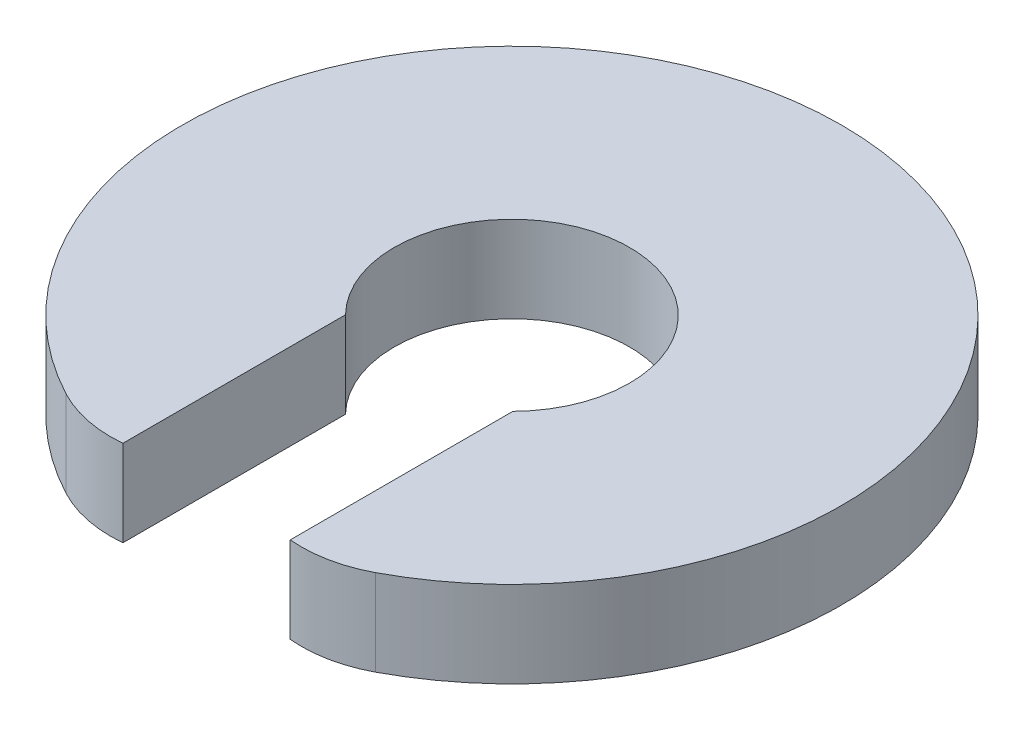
ISO-10303-21;
HEADER;
FILE_DESCRIPTION(('STEP AP214'),'2;1');
FILE_NAME('part.step','',(''),(''),'','','');
FILE_SCHEMA(('AUTOMOTIVE_DESIGN { 1 0 10303 214 1 1 1 1 }'));
ENDSEC;
DATA;
#1=APPLICATION_CONTEXT('core data for automotive mechanical design processes');
#2=APPLICATION_PROTOCOL_DEFINITION('international standard','automotive_design',2000,#1);
#3=PRODUCT_CONTEXT('',#1,'mechanical');
#4=PRODUCT('Part','Part','',(#3));
#5=PRODUCT_RELATED_PRODUCT_CATEGORY('part','',(#4));
#6=PRODUCT_DEFINITION_FORMATION('','',#4);
#7=PRODUCT_DEFINITION_CONTEXT('part definition',#1,'design');
#8=PRODUCT_DEFINITION('design','',#6,#7);
#9=PRODUCT_DEFINITION_SHAPE('','',#8);
#10=(LENGTH_UNIT() NAMED_UNIT(*) SI_UNIT(.MILLI.,.METRE.));
#11=(NAMED_UNIT(*) PLANE_ANGLE_UNIT() SI_UNIT($,.RADIAN.));
#12=(NAMED_UNIT(*) SI_UNIT($,.STERADIAN.) SOLID_ANGLE_UNIT());
#13=UNCERTAINTY_MEASURE_WITH_UNIT(LENGTH_MEASURE(1.E-05),#10,'distance_accuracy_value','');
#14=(GEOMETRIC_REPRESENTATION_CONTEXT(3) GLOBAL_UNCERTAINTY_ASSIGNED_CONTEXT((#13)) GLOBAL_UNIT_ASSIGNED_CONTEXT((#10,
#11,#12)) REPRESENTATION_CONTEXT('',''));
#15=CARTESIAN_POINT('',(0.,0.,0.));
#16=DIRECTION('',(0.,0.,1.));
#17=DIRECTION('',(1.,0.,0.));
#18=AXIS2_PLACEMENT_3D('',#15,#16,#17);
#19=CARTESIAN_POINT('',(165.,170.,650.));
#20=DIRECTION('',(-1.,0.,0.));
#21=DIRECTION('',(0.,0.,1.));
#22=AXIS2_PLACEMENT_3D('',#19,#20,#21);
#23=PLANE('',#22);
#24=DIRECTION('',(0.,1.,0.));
#25=VECTOR('',#24,1.);
#26=CARTESIAN_POINT('',(165.,170.,602.138227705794));
#27=LINE('',#26,#25);
#28=CARTESIAN_POINT('',(165.,0.,602.138227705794));
#29=VERTEX_POINT('',#28);
#30=CARTESIAN_POINT('',(165.,170.,602.138227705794));
#31=VERTEX_POINT('',#30);
#32=EDGE_CURVE('E10',#29,#31,#27,.T.);
#33=ORIENTED_EDGE('',*,*,#32,.T.);
#34=DIRECTION('',(0.,0.,-1.));
#35=VECTOR('',#34,1.);
#36=CARTESIAN_POINT('',(165.,170.,650.));
#37=LINE('',#36,#35);
#38=CARTESIAN_POINT('',(165.,170.,163.09199857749));
#39=VERTEX_POINT('',#38);
#40=EDGE_CURVE('E26',#31,#39,#37,.T.);
#41=ORIENTED_EDGE('',*,*,#40,.T.);
#42=DIRECTION('',(0.,1.,0.));
#43=VECTOR('',#42,1.);
#44=CARTESIAN_POINT('',(165.,170.,163.09199857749));
#45=LINE('',#44,#43);
#46=CARTESIAN_POINT('',(165.,0.,163.09199857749));
#47=VERTEX_POINT('',#46);
#48=EDGE_CURVE('E142',#47,#39,#45,.T.);
#49=ORIENTED_EDGE('',*,*,#48,.F.);
#50=DIRECTION('',(0.,0.,-1.));
#51=VECTOR('',#50,1.);
#52=CARTESIAN_POINT('',(165.,0.,650.));
#53=LINE('',#52,#51);
#54=EDGE_CURVE('E126',#29,#47,#53,.T.);
#55=ORIENTED_EDGE('',*,*,#54,.F.);
#56=EDGE_LOOP('',(#33,#41,#49,#55));
#57=FACE_BOUND('',#56,.T.);
#58=ADVANCED_FACE('F15',(#57),#23,.T.);
#59=CARTESIAN_POINT('',(-165.,170.,0.));
#60=DIRECTION('',(1.,0.,0.));
#61=DIRECTION('',(0.,1.,0.));
#62=AXIS2_PLACEMENT_3D('',#59,#60,#61);
#63=PLANE('',#62);
#64=DIRECTION('',(0.,-1.,0.));
#65=VECTOR('',#64,1.);
#66=CARTESIAN_POINT('',(-165.,170.,602.138227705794));
#67=LINE('',#66,#65);
#68=CARTESIAN_POINT('',(-165.,170.,602.138227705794));
#69=VERTEX_POINT('',#68);
#70=CARTESIAN_POINT('',(-165.,0.,602.138227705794));
#71=VERTEX_POINT('',#70);
#72=EDGE_CURVE('E129',#69,#71,#67,.T.);
#73=ORIENTED_EDGE('',*,*,#72,.T.);
#74=DIRECTION('',(0.,0.,1.));
#75=VECTOR('',#74,1.);
#76=CARTESIAN_POINT('',(-165.,0.,0.));
#77=LINE('',#76,#75);
#78=CARTESIAN_POINT('',(-165.,0.,163.09199857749));
#79=VERTEX_POINT('',#78);
#80=EDGE_CURVE('E109',#79,#71,#77,.T.);
#81=ORIENTED_EDGE('',*,*,#80,.F.);
#82=DIRECTION('',(0.,-1.,0.));
#83=VECTOR('',#82,1.);
#84=CARTESIAN_POINT('',(-165.,170.,163.09199857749));
#85=LINE('',#84,#83);
#86=CARTESIAN_POINT('',(-165.,170.,163.09199857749));
#87=VERTEX_POINT('',#86);
#88=EDGE_CURVE('E121',#87,#79,#85,.T.);
#89=ORIENTED_EDGE('',*,*,#88,.F.);
#90=DIRECTION('',(0.,0.,1.));
#91=VECTOR('',#90,1.);
#92=CARTESIAN_POINT('',(-165.,170.,0.));
#93=LINE('',#92,#91);
#94=EDGE_CURVE('E104',#87,#69,#93,.T.);
#95=ORIENTED_EDGE('',*,*,#94,.T.);
#96=EDGE_LOOP('',(#73,#81,#89,#95));
#97=FACE_BOUND('',#96,.T.);
#98=ADVANCED_FACE('F153',(#97),#63,.T.);
#99=CARTESIAN_POINT('',(-2.22044604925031E-13,170.,0.));
#100=DIRECTION('',(0.,1.,0.));
#101=DIRECTION('',(0.,0.,-1.));
#102=AXIS2_PLACEMENT_3D('',#99,#100,#101);
#103=CYLINDRICAL_SURFACE('',#102,650.);
#104=CARTESIAN_POINT('',(-2.22044604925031E-13,0.,0.));
#105=DIRECTION('',(0.,1.,0.));
#106=DIRECTION('',(1.,0.,0.));
#107=AXIS2_PLACEMENT_3D('',#104,#105,#106);
#108=CIRCLE('',#107,650.);
#109=CARTESIAN_POINT('',(305.156515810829,0.,573.915935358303));
#110=VERTEX_POINT('',#109);
#111=CARTESIAN_POINT('',(-305.156515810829,0.,573.915935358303));
#112=VERTEX_POINT('',#111);
#113=EDGE_CURVE('E97',#110,#112,#108,.T.);
#114=ORIENTED_EDGE('',*,*,#113,.T.);
#115=DIRECTION('',(0.,-1.,0.));
#116=VECTOR('',#115,1.);
#117=CARTESIAN_POINT('',(-305.156515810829,170.,573.915935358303));
#118=LINE('',#117,#116);
#119=CARTESIAN_POINT('',(-305.156515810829,170.,573.915935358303));
#120=VERTEX_POINT('',#119);
#121=EDGE_CURVE('E85',#120,#112,#118,.T.);
#122=ORIENTED_EDGE('',*,*,#121,.F.);
#123=CARTESIAN_POINT('',(-2.22044604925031E-13,170.,0.));
#124=DIRECTION('',(0.,1.,0.));
#125=DIRECTION('',(1.,0.,0.));
#126=AXIS2_PLACEMENT_3D('',#123,#124,#125);
#127=CIRCLE('',#126,650.);
#128=CARTESIAN_POINT('',(305.156515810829,170.,573.915935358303));
#129=VERTEX_POINT('',#128);
#130=EDGE_CURVE('E19',#129,#120,#127,.T.);
#131=ORIENTED_EDGE('',*,*,#130,.F.);
#132=DIRECTION('',(0.,-1.,0.));
#133=VECTOR('',#132,1.);
#134=CARTESIAN_POINT('',(305.156515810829,170.,573.915935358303));
#135=LINE('',#134,#133);
#136=EDGE_CURVE('E99',#129,#110,#135,.T.);
#137=ORIENTED_EDGE('',*,*,#136,.T.);
#138=EDGE_LOOP('',(#114,#122,#131,#137));
#139=FACE_BOUND('',#138,.T.);
#140=ADVANCED_FACE('F17',(#139),#103,.T.);
#141=CARTESIAN_POINT('',(187.788625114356,170.,353.17903714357));
#142=DIRECTION('',(0.,1.,0.));
#143=DIRECTION('',(0.,0.,-1.));
#144=AXIS2_PLACEMENT_3D('',#141,#142,#143);
#145=CYLINDRICAL_SURFACE('',#144,250.);
#146=ORIENTED_EDGE('',*,*,#32,.F.);
#147=CARTESIAN_POINT('',(187.788625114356,0.,353.17903714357));
#148=DIRECTION('',(0.,1.,0.));
#149=DIRECTION('',(1.,0.,0.));
#150=AXIS2_PLACEMENT_3D('',#147,#148,#149);
#151=CIRCLE('',#150,250.);
#152=EDGE_CURVE('E94',#29,#110,#151,.T.);
#153=ORIENTED_EDGE('',*,*,#152,.T.);
#154=ORIENTED_EDGE('',*,*,#136,.F.);
#155=CARTESIAN_POINT('',(187.788625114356,170.,353.17903714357));
#156=DIRECTION('',(0.,1.,0.));
#157=DIRECTION('',(1.,0.,0.));
#158=AXIS2_PLACEMENT_3D('',#155,#156,#157);
#159=CIRCLE('',#158,250.);
#160=EDGE_CURVE('E117',#31,#129,#159,.T.);
#161=ORIENTED_EDGE('',*,*,#160,.F.);
#162=EDGE_LOOP('',(#146,#153,#154,#161));
#163=FACE_BOUND('',#162,.T.);
#164=ADVANCED_FACE('F164',(#163),#145,.T.);
#165=CARTESIAN_POINT('',(-187.788625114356,170.,353.17903714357));
#166=DIRECTION('',(0.,1.,0.));
#167=DIRECTION('',(0.,0.,-1.));
#168=AXIS2_PLACEMENT_3D('',#165,#166,#167);
#169=CYLINDRICAL_SURFACE('',#168,250.);
#170=ORIENTED_EDGE('',*,*,#72,.F.);
#171=CARTESIAN_POINT('',(-187.788625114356,170.,353.17903714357));
#172=DIRECTION('',(0.,1.,0.));
#173=DIRECTION('',(1.,0.,0.));
#174=AXIS2_PLACEMENT_3D('',#171,#172,#173);
#175=CIRCLE('',#174,250.);
#176=EDGE_CURVE('E91',#120,#69,#175,.T.);
#177=ORIENTED_EDGE('',*,*,#176,.F.);
#178=ORIENTED_EDGE('',*,*,#121,.T.);
#179=CARTESIAN_POINT('',(-187.788625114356,0.,353.17903714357));
#180=DIRECTION('',(0.,1.,0.));
#181=DIRECTION('',(1.,0.,0.));
#182=AXIS2_PLACEMENT_3D('',#179,#180,#181);
#183=CIRCLE('',#182,250.);
#184=EDGE_CURVE('E90',#112,#71,#183,.T.);
#185=ORIENTED_EDGE('',*,*,#184,.T.);
#186=EDGE_LOOP('',(#170,#177,#178,#185));
#187=FACE_BOUND('',#186,.T.);
#188=ADVANCED_FACE('F88',(#187),#169,.T.);
#189=CARTESIAN_POINT('',(93.8943125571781,170.,176.589518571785));
#190=DIRECTION('',(0.,1.,0.));
#191=DIRECTION('',(1.,0.,0.));
#192=AXIS2_PLACEMENT_3D('',#189,#190,#191);
#193=PLANE('',#192);
#194=ORIENTED_EDGE('',*,*,#176,.T.);
#195=ORIENTED_EDGE('',*,*,#94,.F.);
#196=CARTESIAN_POINT('',(0.,170.,0.));
#197=DIRECTION('',(0.,1.,0.));
#198=DIRECTION('',(1.,0.,0.));
#199=AXIS2_PLACEMENT_3D('',#196,#197,#198);
#200=CIRCLE('',#199,232.);
#201=EDGE_CURVE('E136',#39,#87,#200,.T.);
#202=ORIENTED_EDGE('',*,*,#201,.F.);
#203=ORIENTED_EDGE('',*,*,#40,.F.);
#204=ORIENTED_EDGE('',*,*,#160,.T.);
#205=ORIENTED_EDGE('',*,*,#130,.T.);
#206=EDGE_LOOP('',(#194,#195,#202,#203,#204,#205));
#207=FACE_BOUND('',#206,.T.);
#208=ADVANCED_FACE('F154',(#207),#193,.T.);
#209=CARTESIAN_POINT('',(93.8943125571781,0.,176.589518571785));
#210=DIRECTION('',(0.,1.,0.));
#211=DIRECTION('',(1.,0.,0.));
#212=AXIS2_PLACEMENT_3D('',#209,#210,#211);
#213=PLANE('',#212);
#214=ORIENTED_EDGE('',*,*,#80,.T.);
#215=ORIENTED_EDGE('',*,*,#184,.F.);
#216=ORIENTED_EDGE('',*,*,#113,.F.);
#217=ORIENTED_EDGE('',*,*,#152,.F.);
#218=ORIENTED_EDGE('',*,*,#54,.T.);
#219=CARTESIAN_POINT('',(0.,0.,0.));
#220=DIRECTION('',(0.,1.,0.));
#221=DIRECTION('',(1.,0.,0.));
#222=AXIS2_PLACEMENT_3D('',#219,#220,#221);
#223=CIRCLE('',#222,232.);
#224=EDGE_CURVE('E134',#47,#79,#223,.T.);
#225=ORIENTED_EDGE('',*,*,#224,.T.);
#226=EDGE_LOOP('',(#214,#215,#216,#217,#218,#225));
#227=FACE_BOUND('',#226,.T.);
#228=ADVANCED_FACE('F106',(#227),#213,.F.);
#229=CARTESIAN_POINT('',(0.,170.,0.));
#230=DIRECTION('',(0.,1.,0.));
#231=DIRECTION('',(0.,0.,-1.));
#232=AXIS2_PLACEMENT_3D('',#229,#230,#231);
#233=CYLINDRICAL_SURFACE('',#232,232.);
#234=ORIENTED_EDGE('',*,*,#201,.T.);
#235=ORIENTED_EDGE('',*,*,#88,.T.);
#236=ORIENTED_EDGE('',*,*,#224,.F.);
#237=ORIENTED_EDGE('',*,*,#48,.T.);
#238=EDGE_LOOP('',(#234,#235,#236,#237));
#239=FACE_BOUND('',#238,.T.);
#240=ADVANCED_FACE('F162',(#239),#233,.F.);
#241=CLOSED_SHELL('',(#58,#98,#140,#164,#188,#208,#228,#240));
#242=MANIFOLD_SOLID_BREP('B1',#241);
#243=ADVANCED_BREP_SHAPE_REPRESENTATION('',(#18,#242),#14);
#244=SHAPE_DEFINITION_REPRESENTATION(#9,#243);
ENDSEC;
END-ISO-10303-21;
